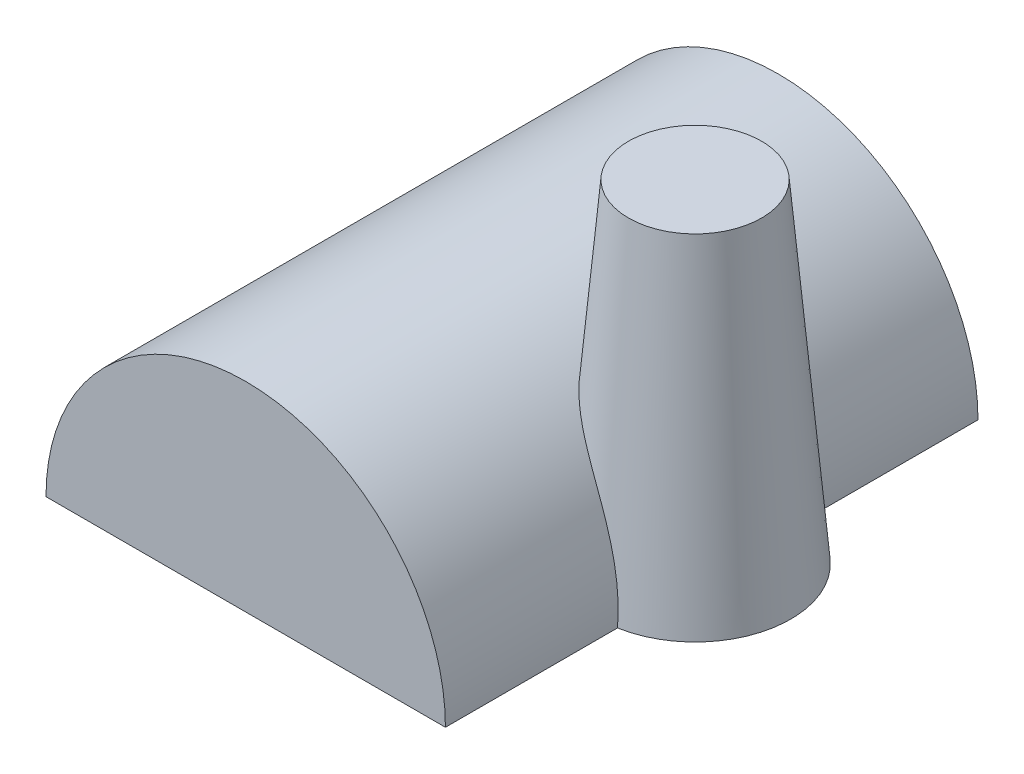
ISO-10303-21;
HEADER;
FILE_DESCRIPTION(('STEP AP214'),'2;1');
FILE_NAME('part.step','',(''),(''),'','','');
FILE_SCHEMA(('AUTOMOTIVE_DESIGN { 1 0 10303 214 1 1 1 1 }'));
ENDSEC;
DATA;
#1=APPLICATION_CONTEXT('core data for automotive mechanical design processes');
#2=APPLICATION_PROTOCOL_DEFINITION('international standard','automotive_design',2000,#1);
#3=PRODUCT_CONTEXT('',#1,'mechanical');
#4=PRODUCT('Part','Part','',(#3));
#5=PRODUCT_RELATED_PRODUCT_CATEGORY('part','',(#4));
#6=PRODUCT_DEFINITION_FORMATION('','',#4);
#7=PRODUCT_DEFINITION_CONTEXT('part definition',#1,'design');
#8=PRODUCT_DEFINITION('design','',#6,#7);
#9=PRODUCT_DEFINITION_SHAPE('','',#8);
#10=(LENGTH_UNIT() NAMED_UNIT(*) SI_UNIT(.MILLI.,.METRE.));
#11=(NAMED_UNIT(*) PLANE_ANGLE_UNIT() SI_UNIT($,.RADIAN.));
#12=(NAMED_UNIT(*) SI_UNIT($,.STERADIAN.) SOLID_ANGLE_UNIT());
#13=UNCERTAINTY_MEASURE_WITH_UNIT(LENGTH_MEASURE(1.E-05),#10,'distance_accuracy_value','');
#14=(GEOMETRIC_REPRESENTATION_CONTEXT(3) GLOBAL_UNCERTAINTY_ASSIGNED_CONTEXT((#13)) GLOBAL_UNIT_ASSIGNED_CONTEXT((#10,
#11,#12)) REPRESENTATION_CONTEXT('',''));
#15=CARTESIAN_POINT('',(0.,0.,0.));
#16=DIRECTION('',(0.,0.,1.));
#17=DIRECTION('',(1.,0.,0.));
#18=AXIS2_PLACEMENT_3D('',#15,#16,#17);
#19=CARTESIAN_POINT('',(0.,0.,-50.8));
#20=DIRECTION('',(0.,0.,1.));
#21=DIRECTION('',(1.,0.,0.));
#22=AXIS2_PLACEMENT_3D('',#19,#20,#21);
#23=CYLINDRICAL_SURFACE('',#22,19.05);
#24=CARTESIAN_POINT('',(19.0499999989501,-0.0002,-34.3886738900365));
#25=CARTESIAN_POINT('',(19.0500067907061,0.26405583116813,-34.3651724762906));
#26=CARTESIAN_POINT('',(19.0445071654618,0.528401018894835,-34.3426779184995));
#27=CARTESIAN_POINT('',(19.0225019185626,1.05678647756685,-34.2996263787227));
#28=CARTESIAN_POINT('',(19.0059964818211,1.32082675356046,-34.2790693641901));
#29=CARTESIAN_POINT('',(18.9619903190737,1.84808130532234,-34.2398194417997));
#30=CARTESIAN_POINT('',(18.9344915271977,2.1112957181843,-34.2211262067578));
#31=CARTESIAN_POINT('',(18.8685352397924,2.63645819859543,-34.1853529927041));
#32=CARTESIAN_POINT('',(18.8300777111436,2.89840626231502,-34.168273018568));
#33=CARTESIAN_POINT('',(18.7418581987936,3.4229573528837,-34.1352013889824));
#34=CARTESIAN_POINT('',(18.6919951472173,3.68554410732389,-34.1192212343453));
#35=CARTESIAN_POINT('',(18.5812500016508,4.20845336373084,-34.0879978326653));
#36=CARTESIAN_POINT('',(18.5203668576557,4.46877564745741,-34.0727546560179));
#37=CARTESIAN_POINT('',(18.3877049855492,4.98660550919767,-34.0423477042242));
#38=CARTESIAN_POINT('',(18.3159273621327,5.24411336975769,-34.0271839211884));
#39=CARTESIAN_POINT('',(18.1616066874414,5.75586434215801,-33.9961406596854));
#40=CARTESIAN_POINT('',(18.0790626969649,6.01010716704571,-33.9802611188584));
#41=CARTESIAN_POINT('',(17.9027011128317,6.51677103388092,-33.9467381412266));
#42=CARTESIAN_POINT('',(17.8088005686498,6.76916237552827,-33.9290819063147));
#43=CARTESIAN_POINT('',(17.6104486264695,7.26959777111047,-33.8910410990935));
#44=CARTESIAN_POINT('',(17.5059958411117,7.51764124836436,-33.8706561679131));
#45=CARTESIAN_POINT('',(17.2867806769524,8.00887485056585,-33.8259624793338));
#46=CARTESIAN_POINT('',(17.1720149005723,8.25206334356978,-33.8016524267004));
#47=CARTESIAN_POINT('',(16.9325440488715,8.73290232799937,-33.7478039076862));
#48=CARTESIAN_POINT('',(16.8078393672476,8.97055303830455,-33.7182656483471));
#49=CARTESIAN_POINT('',(16.5497161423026,9.43823543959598,-33.6527373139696));
#50=CARTESIAN_POINT('',(16.4163561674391,9.66830511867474,-33.6167882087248));
#51=CARTESIAN_POINT('',(16.1408106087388,10.1216138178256,-33.5368185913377));
#52=CARTESIAN_POINT('',(15.9986266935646,10.3448541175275,-33.4927996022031));
#53=CARTESIAN_POINT('',(15.706247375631,10.7835854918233,-33.3951294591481));
#54=CARTESIAN_POINT('',(15.5560591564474,10.9990832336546,-33.3414868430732));
#55=CARTESIAN_POINT('',(15.2485130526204,11.4216288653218,-33.2228906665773));
#56=CARTESIAN_POINT('',(15.0911569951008,11.628678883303,-33.1579399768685));
#57=CARTESIAN_POINT('',(14.7678801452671,12.0366526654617,-33.0138817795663));
#58=CARTESIAN_POINT('',(14.6018631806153,12.2374274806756,-32.9345663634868));
#59=CARTESIAN_POINT('',(14.2652146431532,12.6282480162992,-32.760737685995));
#60=CARTESIAN_POINT('',(14.0945836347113,12.8182950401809,-32.6662262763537));
#61=CARTESIAN_POINT('',(13.7508144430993,13.1863931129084,-32.4604234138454));
#62=CARTESIAN_POINT('',(13.5776784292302,13.3644538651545,-32.349145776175));
#63=CARTESIAN_POINT('',(13.2311902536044,13.707571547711,-32.1083169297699));
#64=CARTESIAN_POINT('',(13.057838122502,13.8726301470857,-31.9787680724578));
#65=CARTESIAN_POINT('',(12.7397351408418,14.1647812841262,-31.7213307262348));
#66=CARTESIAN_POINT('',(12.5946131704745,14.2938456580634,-31.5961375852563));
#67=CARTESIAN_POINT('',(12.3082680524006,14.5411418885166,-31.3314340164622));
#68=CARTESIAN_POINT('',(12.1670441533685,14.6593758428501,-31.1919263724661));
#69=CARTESIAN_POINT('',(11.8905849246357,14.8844980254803,-30.8984887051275));
#70=CARTESIAN_POINT('',(11.7553502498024,14.9913850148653,-30.7445571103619));
#71=CARTESIAN_POINT('',(11.4931012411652,15.1933711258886,-30.4225670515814));
#72=CARTESIAN_POINT('',(11.3660870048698,15.2884701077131,-30.2545084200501));
#73=CARTESIAN_POINT('',(11.1217388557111,15.4671422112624,-29.9038322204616));
#74=CARTESIAN_POINT('',(11.0044706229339,15.5506393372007,-29.7211299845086));
#75=CARTESIAN_POINT('',(10.7826823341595,15.7052395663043,-29.3431463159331));
#76=CARTESIAN_POINT('',(10.6781626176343,15.7763423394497,-29.1478645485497));
#77=CARTESIAN_POINT('',(10.4838962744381,15.9061017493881,-28.7461933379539));
#78=CARTESIAN_POINT('',(10.3941457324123,15.9647616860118,-28.5398068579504));
#79=CARTESIAN_POINT('',(10.2311292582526,16.0697202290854,-28.1176025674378));
#80=CARTESIAN_POINT('',(10.1578614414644,16.1160202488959,-27.9017858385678));
#81=CARTESIAN_POINT('',(10.0364762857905,16.1918549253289,-27.4874376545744));
#82=CARTESIAN_POINT('',(9.98645524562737,16.2226908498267,-27.289698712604));
#83=CARTESIAN_POINT('',(9.9012608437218,16.2748282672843,-26.8898140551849));
#84=CARTESIAN_POINT('',(9.86608671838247,16.2961302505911,-26.6876685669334));
#85=CARTESIAN_POINT('',(9.81112913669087,16.3292766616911,-26.2805860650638));
#86=CARTESIAN_POINT('',(9.79134157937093,16.3411236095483,-26.0756498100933));
#87=CARTESIAN_POINT('',(9.76744125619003,16.355420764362,-25.6645379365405));
#88=CARTESIAN_POINT('',(9.76332826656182,16.3578711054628,-25.4583623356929));
#89=CARTESIAN_POINT('',(9.77066385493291,16.3534901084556,-25.0559144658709));
#90=CARTESIAN_POINT('',(9.78140322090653,16.3470817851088,-24.8596241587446));
#91=CARTESIAN_POINT('',(9.81704829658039,16.3257004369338,-24.4688091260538));
#92=CARTESIAN_POINT('',(9.84195354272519,16.3107276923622,-24.274284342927));
#93=CARTESIAN_POINT('',(9.9055812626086,16.2721645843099,-23.888409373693));
#94=CARTESIAN_POINT('',(9.94430151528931,16.2485756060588,-23.6970586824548));
#95=CARTESIAN_POINT('',(10.0350236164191,16.1927031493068,-23.3188283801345));
#96=CARTESIAN_POINT('',(10.0870256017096,16.1604195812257,-23.13194881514));
#97=CARTESIAN_POINT('',(10.2036023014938,16.0870674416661,-22.7638758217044));
#98=CARTESIAN_POINT('',(10.2681800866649,16.0459967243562,-22.582683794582));
#99=CARTESIAN_POINT('',(10.4090007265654,15.9550062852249,-22.2271942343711));
#100=CARTESIAN_POINT('',(10.485243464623,15.9050866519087,-22.0528966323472));
#101=CARTESIAN_POINT('',(10.6483359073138,15.7963616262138,-21.7122304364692));
#102=CARTESIAN_POINT('',(10.7351852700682,15.7375565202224,-21.5458615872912));
#103=CARTESIAN_POINT('',(10.9183053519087,15.6110693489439,-21.2219215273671));
#104=CARTESIAN_POINT('',(11.0145763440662,15.5433870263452,-21.0643505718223));
#105=CARTESIAN_POINT('',(11.2192636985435,15.3963347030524,-20.7525991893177));
#106=CARTESIAN_POINT('',(11.3280117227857,15.3166056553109,-20.5988060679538));
#107=CARTESIAN_POINT('',(11.5527781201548,15.1477908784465,-20.3020722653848));
#108=CARTESIAN_POINT('',(11.6687964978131,15.0587051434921,-20.1591315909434));
#109=CARTESIAN_POINT('',(11.9065866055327,14.8714019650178,-19.8844053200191));
#110=CARTESIAN_POINT('',(12.0283595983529,14.7731825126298,-19.7526221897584));
#111=CARTESIAN_POINT('',(12.2761273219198,14.5679475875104,-19.5003362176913));
#112=CARTESIAN_POINT('',(12.4021228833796,14.4609303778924,-19.3798356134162));
#113=CARTESIAN_POINT('',(12.7027792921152,14.1984058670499,-19.10862046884));
#114=CARTESIAN_POINT('',(12.878620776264,14.0393182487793,-18.9626590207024));
#115=CARTESIAN_POINT('',(13.2320556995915,13.7067188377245,-18.6906536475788));
#116=CARTESIAN_POINT('',(13.4096496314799,13.5332028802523,-18.5646155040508));
#117=CARTESIAN_POINT('',(13.7638658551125,13.1727900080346,-18.3310358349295));
#118=CARTESIAN_POINT('',(13.9404867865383,12.9858778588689,-18.2235158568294));
#119=CARTESIAN_POINT('',(14.2901627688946,12.6000640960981,-18.0254851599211));
#120=CARTESIAN_POINT('',(14.4632167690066,12.4011590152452,-17.9349793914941));
#121=CARTESIAN_POINT('',(14.8751182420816,11.9069546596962,-17.7344193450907));
#122=CARTESIAN_POINT('',(15.1111599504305,11.6061788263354,-17.6320576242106));
#123=CARTESIAN_POINT('',(15.5678617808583,10.986023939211,-17.4524568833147));
#124=CARTESIAN_POINT('',(15.7885152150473,10.6666369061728,-17.3752287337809));
#125=CARTESIAN_POINT('',(16.2120108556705,10.0112820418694,-17.2404251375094));
#126=CARTESIAN_POINT('',(16.4148106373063,9.67527753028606,-17.1828956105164));
#127=CARTESIAN_POINT('',(16.8000486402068,8.98974653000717,-17.0827565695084));
#128=CARTESIAN_POINT('',(16.9824873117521,8.6402203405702,-17.0401467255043));
#129=CARTESIAN_POINT('',(17.3843530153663,7.80813577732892,-16.952527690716));
#130=CARTESIAN_POINT('',(17.5951103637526,7.32093937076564,-16.9116759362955));
#131=CARTESIAN_POINT('',(17.9754601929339,6.32986684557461,-16.8393027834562));
#132=CARTESIAN_POINT('',(18.1450363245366,5.82598419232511,-16.8077850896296));
#133=CARTESIAN_POINT('',(18.3672616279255,5.06128593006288,-16.7619993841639));
#134=CARTESIAN_POINT('',(18.4359468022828,4.80507300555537,-16.7469950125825));
#135=CARTESIAN_POINT('',(18.5625563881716,4.29002246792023,-16.7167529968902));
#136=CARTESIAN_POINT('',(18.6204817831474,4.03118509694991,-16.7015153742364));
#137=CARTESIAN_POINT('',(18.7254423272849,3.51149031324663,-16.6701922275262));
#138=CARTESIAN_POINT('',(18.7724823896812,3.250633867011,-16.6541070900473));
#139=CARTESIAN_POINT('',(18.8556237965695,2.72729427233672,-16.6206023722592));
#140=CARTESIAN_POINT('',(18.891726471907,2.46481132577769,-16.6031829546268));
#141=CARTESIAN_POINT('',(18.9436240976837,2.01879691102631,-16.572226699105));
#142=CARTESIAN_POINT('',(18.9622553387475,1.83556039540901,-16.5591225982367));
#143=CARTESIAN_POINT('',(18.9941894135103,1.4687249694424,-16.5320264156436));
#144=CARTESIAN_POINT('',(19.0074932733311,1.28512613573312,-16.5180345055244));
#145=CARTESIAN_POINT('',(19.0393837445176,0.734491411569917,-16.4747151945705));
#146=CARTESIAN_POINT('',(19.0500106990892,0.367088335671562,-16.4440078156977));
#147=CARTESIAN_POINT('',(19.0499999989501,-0.000199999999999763,-16.4113261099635));
#148=B_SPLINE_CURVE_WITH_KNOTS('',3,(#24,#25,#26,#27,#28,#29,#30,#31,#32,#33,#34,#35,#36,#37,
#38,#39,#40,#41,#42,#43,#44,#45,#46,#47,#48,#49,#50,#51,#52,#53,#54,#55,#56,#57,#58,#59,#60,#61,
#62,#63,#64,#65,#66,#67,#68,#69,#70,#71,#72,#73,#74,#75,#76,#77,#78,#79,#80,#81,#82,#83,#84,#85,
#86,#87,#88,#89,#90,#91,#92,#93,#94,#95,#96,#97,#98,#99,#100,#101,#102,#103,#104,#105,#106,#107,
#108,#109,#110,#111,#112,#113,#114,#115,#116,#117,#118,#119,#120,#121,#122,#123,#124,#125,#126,
#127,#128,#129,#130,#131,#132,#133,#134,#135,#136,#137,#138,#139,#140,#141,#142,#143,#144,#145,
#146,#147),.UNSPECIFIED.,.F.,.F.,(4,2,2,2,2,2,2,2,2,2,2,2,2,2,2,2,2,2,2,2,2,2,2,2,2,2,2,2,2,2,2,
2,2,2,2,2,2,2,2,2,2,2,2,2,2,2,2,2,2,2,2,2,2,2,2,2,2,2,2,2,2,4),(0.,0.795837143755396,
1.59166091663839,2.38734473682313,3.18303096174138,3.98606167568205,4.78916894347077,
5.59219483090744,6.39529081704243,7.20465403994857,8.01412381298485,8.82386124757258,
9.63356662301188,10.4382716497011,11.2428249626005,12.0466679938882,12.8503072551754,
13.6666735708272,14.4829404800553,15.2985384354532,16.1140315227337,16.8065546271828,
17.4989433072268,18.1914075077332,18.8838799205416,19.5806935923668,20.2775258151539,
20.9741730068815,21.6707405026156,22.2888178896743,22.9068634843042,23.5247442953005,
24.1426162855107,24.7319813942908,25.3213272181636,25.910578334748,26.4998355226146,
27.0892367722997,27.6786321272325,28.2680084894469,28.8574019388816,29.4703553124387,
30.0833090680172,30.6963979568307,31.309608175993,32.1437174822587,32.978068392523,
33.8133836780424,34.6489416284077,35.8345107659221,37.0205919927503,38.2094195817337,
39.398220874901,40.9933341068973,42.5890795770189,43.3859407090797,44.182728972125,
44.9791568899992,45.7754878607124,46.3293538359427,46.8831130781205,47.9890329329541),.UNSPECIFIED.);
#149=CARTESIAN_POINT('',(19.05,0.,-34.388656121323));
#150=VERTEX_POINT('',#149);
#151=CARTESIAN_POINT('',(19.05,0.,-16.411343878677));
#152=VERTEX_POINT('',#151);
#153=EDGE_CURVE('E73',#150,#152,#148,.T.);
#154=ORIENTED_EDGE('',*,*,#153,.F.);
#155=DIRECTION('',(0.,0.,1.));
#156=VECTOR('',#155,1.);
#157=CARTESIAN_POINT('',(19.05,0.,-50.8));
#158=LINE('',#157,#156);
#159=CARTESIAN_POINT('',(19.05,0.,-50.8));
#160=VERTEX_POINT('',#159);
#161=EDGE_CURVE('E11',#160,#150,#158,.T.);
#162=ORIENTED_EDGE('',*,*,#161,.F.);
#163=CARTESIAN_POINT('',(0.,0.,-50.8));
#164=DIRECTION('',(0.,0.,1.));
#165=DIRECTION('',(1.,0.,0.));
#166=AXIS2_PLACEMENT_3D('',#163,#164,#165);
#167=CIRCLE('',#166,19.05);
#168=CARTESIAN_POINT('',(-19.05,0.,-50.8));
#169=VERTEX_POINT('',#168);
#170=EDGE_CURVE('E76',#160,#169,#167,.T.);
#171=ORIENTED_EDGE('',*,*,#170,.T.);
#172=DIRECTION('',(0.,0.,1.));
#173=VECTOR('',#172,1.);
#174=CARTESIAN_POINT('',(-19.05,0.,-50.8));
#175=LINE('',#174,#173);
#176=CARTESIAN_POINT('',(-19.05,0.,0.));
#177=VERTEX_POINT('',#176);
#178=EDGE_CURVE('E36',#169,#177,#175,.T.);
#179=ORIENTED_EDGE('',*,*,#178,.T.);
#180=CARTESIAN_POINT('',(0.,0.,0.));
#181=DIRECTION('',(0.,0.,1.));
#182=DIRECTION('',(1.,0.,0.));
#183=AXIS2_PLACEMENT_3D('',#180,#181,#182);
#184=CIRCLE('',#183,19.05);
#185=CARTESIAN_POINT('',(19.05,0.,0.));
#186=VERTEX_POINT('',#185);
#187=EDGE_CURVE('E71',#186,#177,#184,.T.);
#188=ORIENTED_EDGE('',*,*,#187,.F.);
#189=EDGE_CURVE('E41',#152,#186,#158,.T.);
#190=ORIENTED_EDGE('',*,*,#189,.F.);
#191=EDGE_LOOP('',(#154,#162,#171,#179,#188,#190));
#192=FACE_BOUND('',#191,.T.);
#193=ADVANCED_FACE('F32',(#192),#23,.T.);
#194=CARTESIAN_POINT('',(-19.05,0.,-50.8));
#195=DIRECTION('',(0.,-1.,0.));
#196=DIRECTION('',(0.,0.,-1.));
#197=AXIS2_PLACEMENT_3D('',#194,#195,#196);
#198=PLANE('',#197);
#199=ORIENTED_EDGE('',*,*,#161,.T.);
#200=CARTESIAN_POINT('',(17.4625,0.,-25.4));
#201=DIRECTION('',(0.,1.,0.));
#202=DIRECTION('',(0.,0.,1.));
#203=AXIS2_PLACEMENT_3D('',#200,#201,#202);
#204=CIRCLE('',#203,9.12776506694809);
#205=EDGE_CURVE('E47',#152,#150,#204,.T.);
#206=ORIENTED_EDGE('',*,*,#205,.F.);
#207=ORIENTED_EDGE('',*,*,#189,.T.);
#208=DIRECTION('',(1.,0.,0.));
#209=VECTOR('',#208,1.);
#210=CARTESIAN_POINT('',(-19.05,0.,0.));
#211=LINE('',#210,#209);
#212=EDGE_CURVE('E69',#177,#186,#211,.T.);
#213=ORIENTED_EDGE('',*,*,#212,.F.);
#214=ORIENTED_EDGE('',*,*,#178,.F.);
#215=DIRECTION('',(1.,0.,0.));
#216=VECTOR('',#215,1.);
#217=CARTESIAN_POINT('',(-19.05,0.,-50.8));
#218=LINE('',#217,#216);
#219=EDGE_CURVE('E78',#169,#160,#218,.T.);
#220=ORIENTED_EDGE('',*,*,#219,.T.);
#221=EDGE_LOOP('',(#199,#206,#207,#213,#214,#220));
#222=FACE_BOUND('',#221,.T.);
#223=ADVANCED_FACE('F67',(#222),#198,.T.);
#224=CARTESIAN_POINT('',(0.,0.,-50.8));
#225=DIRECTION('',(0.,0.,1.));
#226=DIRECTION('',(1.,0.,0.));
#227=AXIS2_PLACEMENT_3D('',#224,#225,#226);
#228=PLANE('',#227);
#229=ORIENTED_EDGE('',*,*,#170,.F.);
#230=ORIENTED_EDGE('',*,*,#219,.F.);
#231=EDGE_LOOP('',(#229,#230));
#232=FACE_BOUND('',#231,.T.);
#233=ADVANCED_FACE('F97',(#232),#228,.F.);
#234=CARTESIAN_POINT('',(0.,0.,0.));
#235=DIRECTION('',(0.,0.,1.));
#236=DIRECTION('',(1.,0.,0.));
#237=AXIS2_PLACEMENT_3D('',#234,#235,#236);
#238=PLANE('',#237);
#239=ORIENTED_EDGE('',*,*,#187,.T.);
#240=ORIENTED_EDGE('',*,*,#212,.T.);
#241=EDGE_LOOP('',(#239,#240));
#242=FACE_BOUND('',#241,.T.);
#243=ADVANCED_FACE('F75',(#242),#238,.T.);
#244=CARTESIAN_POINT('',(17.4625,31.75,-25.4));
#245=DIRECTION('',(0.,-1.,0.));
#246=DIRECTION('',(0.,0.,1.));
#247=AXIS2_PLACEMENT_3D('',#244,#245,#246);
#248=CONICAL_SURFACE('',#247,6.35,0.0872664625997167);
#249=ORIENTED_EDGE('',*,*,#205,.T.);
#250=ORIENTED_EDGE('',*,*,#153,.T.);
#251=EDGE_LOOP('',(#249,#250));
#252=FACE_BOUND('',#251,.T.);
#253=CARTESIAN_POINT('',(17.4625,31.75,-25.4));
#254=DIRECTION('',(0.,1.,0.));
#255=DIRECTION('',(0.,0.,1.));
#256=AXIS2_PLACEMENT_3D('',#253,#254,#255);
#257=CIRCLE('',#256,6.35);
#258=CARTESIAN_POINT('',(17.4625,31.75,-19.05));
#259=VERTEX_POINT('',#258);
#260=EDGE_CURVE('E137',#259,#259,#257,.T.);
#261=ORIENTED_EDGE('',*,*,#260,.F.);
#262=EDGE_LOOP('',(#261));
#263=FACE_BOUND('',#262,.T.);
#264=ADVANCED_FACE('F90',(#252,#263),#248,.T.);
#265=CARTESIAN_POINT('',(17.4625,31.75,-25.4));
#266=DIRECTION('',(0.,1.,0.));
#267=DIRECTION('',(0.,0.,1.));
#268=AXIS2_PLACEMENT_3D('',#265,#266,#267);
#269=PLANE('',#268);
#270=ORIENTED_EDGE('',*,*,#260,.T.);
#271=EDGE_LOOP('',(#270));
#272=FACE_BOUND('',#271,.T.);
#273=ADVANCED_FACE('F95',(#272),#269,.T.);
#274=CLOSED_SHELL('',(#193,#223,#233,#243,#264,#273));
#275=MANIFOLD_SOLID_BREP('B2',#274);
#276=ADVANCED_BREP_SHAPE_REPRESENTATION('',(#18,#275),#14);
#277=SHAPE_DEFINITION_REPRESENTATION(#9,#276);
ENDSEC;
END-ISO-10303-21;
